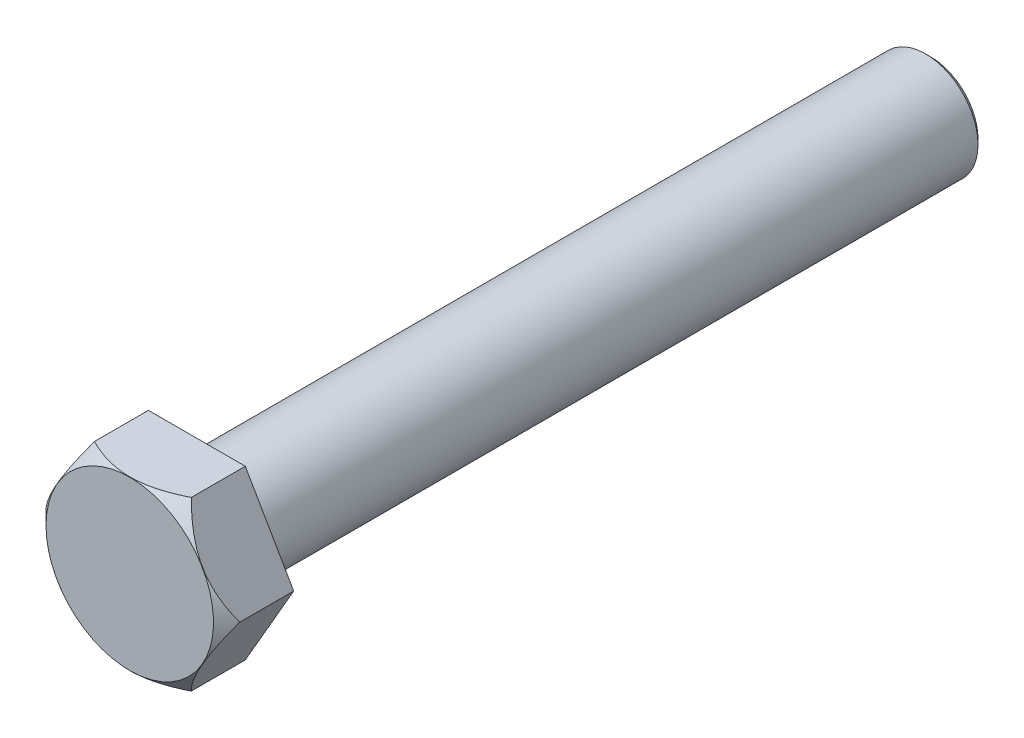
ISO-10303-21;
HEADER;
FILE_DESCRIPTION(('STEP AP214'),'2;1');
FILE_NAME('part.step','',(''),(''),'','','');
FILE_SCHEMA(('AUTOMOTIVE_DESIGN { 1 0 10303 214 1 1 1 1 }'));
ENDSEC;
DATA;
#1=APPLICATION_CONTEXT('core data for automotive mechanical design processes');
#2=APPLICATION_PROTOCOL_DEFINITION('international standard','automotive_design',2000,#1);
#3=PRODUCT_CONTEXT('',#1,'mechanical');
#4=PRODUCT('Part','Part','',(#3));
#5=PRODUCT_RELATED_PRODUCT_CATEGORY('part','',(#4));
#6=PRODUCT_DEFINITION_FORMATION('','',#4);
#7=PRODUCT_DEFINITION_CONTEXT('part definition',#1,'design');
#8=PRODUCT_DEFINITION('design','',#6,#7);
#9=PRODUCT_DEFINITION_SHAPE('','',#8);
#10=(LENGTH_UNIT() NAMED_UNIT(*) SI_UNIT(.MILLI.,.METRE.));
#11=(NAMED_UNIT(*) PLANE_ANGLE_UNIT() SI_UNIT($,.RADIAN.));
#12=(NAMED_UNIT(*) SI_UNIT($,.STERADIAN.) SOLID_ANGLE_UNIT());
#13=UNCERTAINTY_MEASURE_WITH_UNIT(LENGTH_MEASURE(1.E-05),#10,'distance_accuracy_value','');
#14=(GEOMETRIC_REPRESENTATION_CONTEXT(3) GLOBAL_UNCERTAINTY_ASSIGNED_CONTEXT((#13)) GLOBAL_UNIT_ASSIGNED_CONTEXT((#10,
#11,#12)) REPRESENTATION_CONTEXT('',''));
#15=CARTESIAN_POINT('',(0.,0.,0.));
#16=DIRECTION('',(0.,0.,1.));
#17=DIRECTION('',(1.,0.,0.));
#18=AXIS2_PLACEMENT_3D('',#15,#16,#17);
#19=CARTESIAN_POINT('',(0.,-5.,0.));
#20=DIRECTION('',(0.,0.,1.));
#21=DIRECTION('',(1.,0.,0.));
#22=AXIS2_PLACEMENT_3D('',#19,#20,#21);
#23=PLANE('',#22);
#24=CARTESIAN_POINT('',(0.,0.,0.));
#25=DIRECTION('',(0.,0.,1.));
#26=DIRECTION('',(1.,0.,0.));
#27=AXIS2_PLACEMENT_3D('',#24,#25,#26);
#28=CIRCLE('',#27,5.);
#29=CARTESIAN_POINT('',(5.,0.,0.));
#30=VERTEX_POINT('',#29);
#31=EDGE_CURVE('E11',#30,#30,#28,.T.);
#32=ORIENTED_EDGE('',*,*,#31,.T.);
#33=EDGE_LOOP('',(#32));
#34=FACE_BOUND('',#33,.T.);
#35=ADVANCED_FACE('F38',(#34),#23,.T.);
#36=CARTESIAN_POINT('',(0.,0.,0.));
#37=DIRECTION('',(0.,0.,1.));
#38=DIRECTION('',(1.,0.,0.));
#39=AXIS2_PLACEMENT_3D('',#36,#37,#38);
#40=CYLINDRICAL_SURFACE('',#39,5.);
#41=CARTESIAN_POINT('',(0.,0.,-69.5));
#42=DIRECTION('',(0.,0.,1.));
#43=DIRECTION('',(1.,0.,0.));
#44=AXIS2_PLACEMENT_3D('',#41,#42,#43);
#45=CIRCLE('',#44,5.);
#46=CARTESIAN_POINT('',(5.,0.,-69.5));
#47=VERTEX_POINT('',#46);
#48=EDGE_CURVE('E44',#47,#47,#45,.T.);
#49=ORIENTED_EDGE('',*,*,#48,.T.);
#50=EDGE_LOOP('',(#49));
#51=FACE_BOUND('',#50,.T.);
#52=ORIENTED_EDGE('',*,*,#31,.F.);
#53=EDGE_LOOP('',(#52));
#54=FACE_BOUND('',#53,.T.);
#55=ADVANCED_FACE('F64',(#51,#54),#40,.T.);
#56=CARTESIAN_POINT('',(0.,0.,-69.5));
#57=DIRECTION('',(0.,0.,1.));
#58=DIRECTION('',(1.,0.,0.));
#59=AXIS2_PLACEMENT_3D('',#56,#57,#58);
#60=CONICAL_SURFACE('',#59,5.,0.785398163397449);
#61=CARTESIAN_POINT('',(0.,0.,-70.));
#62=DIRECTION('',(0.,0.,1.));
#63=DIRECTION('',(1.,0.,0.));
#64=AXIS2_PLACEMENT_3D('',#61,#62,#63);
#65=CIRCLE('',#64,4.5);
#66=CARTESIAN_POINT('',(4.5,0.,-70.));
#67=VERTEX_POINT('',#66);
#68=EDGE_CURVE('E48',#67,#67,#65,.T.);
#69=ORIENTED_EDGE('',*,*,#68,.T.);
#70=EDGE_LOOP('',(#69));
#71=FACE_BOUND('',#70,.T.);
#72=ORIENTED_EDGE('',*,*,#48,.F.);
#73=EDGE_LOOP('',(#72));
#74=FACE_BOUND('',#73,.T.);
#75=ADVANCED_FACE('F55',(#71,#74),#60,.T.);
#76=CARTESIAN_POINT('',(0.,-4.5,-70.));
#77=DIRECTION('',(0.,0.,-1.));
#78=DIRECTION('',(-1.,0.,0.));
#79=AXIS2_PLACEMENT_3D('',#76,#77,#78);
#80=PLANE('',#79);
#81=ORIENTED_EDGE('',*,*,#68,.F.);
#82=EDGE_LOOP('',(#81));
#83=FACE_BOUND('',#82,.T.);
#84=ADVANCED_FACE('F58',(#83),#80,.T.);
#85=CLOSED_SHELL('',(#35,#55,#75,#84));
#86=MANIFOLD_SOLID_BREP('B2',#85);
#87=CARTESIAN_POINT('',(4.61880215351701,-8.,6.4));
#88=DIRECTION('',(-0.866025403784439,0.5,0.));
#89=DIRECTION('',(-0.5,-0.866025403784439,0.));
#90=AXIS2_PLACEMENT_3D('',#87,#88,#89);
#91=PLANE('',#90);
#92=DIRECTION('',(0.,0.,-1.));
#93=VECTOR('',#92,1.);
#94=CARTESIAN_POINT('',(9.23760430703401,0.,6.4));
#95=LINE('',#94,#93);
#96=CARTESIAN_POINT('',(9.23760430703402,0.,5.15));
#97=VERTEX_POINT('',#96);
#98=CARTESIAN_POINT('',(9.23760430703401,0.,0.));
#99=VERTEX_POINT('',#98);
#100=EDGE_CURVE('E36',#97,#99,#95,.T.);
#101=ORIENTED_EDGE('',*,*,#100,.F.);
#102=CARTESIAN_POINT('',(9.23771977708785,0.0002,5.14988452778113));
#103=CARTESIAN_POINT('',(9.15830362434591,-0.137352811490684,5.22929173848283));
#104=CARTESIAN_POINT('',(9.07827704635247,-0.275962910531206,5.30626202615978));
#105=CARTESIAN_POINT('',(8.91688328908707,-0.555505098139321,5.45458746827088));
#106=CARTESIAN_POINT('',(8.83551540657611,-0.696438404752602,5.52593955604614));
#107=CARTESIAN_POINT('',(8.58846429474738,-1.12434348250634,5.7310650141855));
#108=CARTESIAN_POINT('',(8.42068969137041,-1.41493761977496,5.85503254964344));
#109=CARTESIAN_POINT('',(8.08235881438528,-2.00094388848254,6.0673182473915));
#110=CARTESIAN_POINT('',(7.91188900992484,-2.29620625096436,6.15617121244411));
#111=CARTESIAN_POINT('',(7.65338180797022,-2.74395385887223,6.25895214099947));
#112=CARTESIAN_POINT('',(7.5668321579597,-2.89386225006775,6.2881156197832));
#113=CARTESIAN_POINT('',(7.39300005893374,-3.19494827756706,6.33561647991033));
#114=CARTESIAN_POINT('',(7.30571772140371,-3.34612572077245,6.35395547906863));
#115=CARTESIAN_POINT('',(7.09302093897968,-3.71452735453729,6.38470362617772));
#116=CARTESIAN_POINT('',(6.96737731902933,-3.93214848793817,6.3911549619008));
#117=CARTESIAN_POINT('',(6.71631655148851,-4.36699849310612,6.38032538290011));
#118=CARTESIAN_POINT('',(6.59089949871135,-4.58422720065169,6.36303614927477));
#119=CARTESIAN_POINT('',(6.3412478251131,-5.01663658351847,6.30574456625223));
#120=CARTESIAN_POINT('',(6.21701468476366,-5.23181469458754,6.26571681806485));
#121=CARTESIAN_POINT('',(5.97068367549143,-5.65847251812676,6.16512435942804));
#122=CARTESIAN_POINT('',(5.84858564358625,-5.86995251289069,6.1045612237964));
#123=CARTESIAN_POINT('',(5.63184322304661,-6.24536139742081,5.97996636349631));
#124=CARTESIAN_POINT('',(5.53671883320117,-6.41012167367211,5.91921187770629));
#125=CARTESIAN_POINT('',(5.34817758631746,-6.73668469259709,5.78791284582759));
#126=CARTESIAN_POINT('',(5.25476078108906,-6.89848734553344,5.7173680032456));
#127=CARTESIAN_POINT('',(5.06992894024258,-7.21862548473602,5.56806952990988));
#128=CARTESIAN_POINT('',(4.97850864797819,-7.37697007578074,5.48934171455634));
#129=CARTESIAN_POINT('',(4.79736084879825,-7.69072726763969,5.32471082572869));
#130=CARTESIAN_POINT('',(4.70763234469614,-7.84614159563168,5.23881215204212));
#131=CARTESIAN_POINT('',(4.61868668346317,-8.0002,5.14988452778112));
#132=B_SPLINE_CURVE_WITH_KNOTS('',3,(#102,#103,#104,#105,#106,#107,#108,#109,#110,#111,#112,
#113,#114,#115,#116,#117,#118,#119,#120,#121,#122,#123,#124,#125,#126,#127,#128,#129,#130,#131),
.UNSPECIFIED.,.F.,.F.,(4,2,2,2,2,2,2,2,2,2,2,2,2,2,4),(0.,0.532696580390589,1.06568194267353,
2.13740664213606,3.19211397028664,3.71843331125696,4.24467396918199,4.99761238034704,
5.75081469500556,6.50485999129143,7.25884747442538,7.85770857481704,8.45658781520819,
9.05363199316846,9.65031250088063),.UNSPECIFIED.);
#133=CARTESIAN_POINT('',(4.61880215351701,-8.,5.15));
#134=VERTEX_POINT('',#133);
#135=EDGE_CURVE('E199',#97,#134,#132,.T.);
#136=ORIENTED_EDGE('',*,*,#135,.T.);
#137=DIRECTION('',(0.,0.,-1.));
#138=VECTOR('',#137,1.);
#139=CARTESIAN_POINT('',(4.61880215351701,-8.,6.4));
#140=LINE('',#139,#138);
#141=CARTESIAN_POINT('',(4.61880215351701,-8.,0.));
#142=VERTEX_POINT('',#141);
#143=EDGE_CURVE('E116',#134,#142,#140,.T.);
#144=ORIENTED_EDGE('',*,*,#143,.T.);
#145=DIRECTION('',(0.5,0.866025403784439,0.));
#146=VECTOR('',#145,1.);
#147=CARTESIAN_POINT('',(4.61880215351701,-8.,0.));
#148=LINE('',#147,#146);
#149=EDGE_CURVE('E186',#142,#99,#148,.T.);
#150=ORIENTED_EDGE('',*,*,#149,.T.);
#151=EDGE_LOOP('',(#101,#136,#144,#150));
#152=FACE_BOUND('',#151,.T.);
#153=ADVANCED_FACE('F93',(#152),#91,.F.);
#154=CARTESIAN_POINT('',(9.23760430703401,0.,6.4));
#155=DIRECTION('',(-0.866025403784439,-0.5,0.));
#156=DIRECTION('',(0.5,-0.866025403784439,0.));
#157=AXIS2_PLACEMENT_3D('',#154,#155,#156);
#158=PLANE('',#157);
#159=DIRECTION('',(0.,0.,-1.));
#160=VECTOR('',#159,1.);
#161=CARTESIAN_POINT('',(4.61880215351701,8.,6.4));
#162=LINE('',#161,#160);
#163=CARTESIAN_POINT('',(4.61880215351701,8.,5.15));
#164=VERTEX_POINT('',#163);
#165=CARTESIAN_POINT('',(4.61880215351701,8.,0.));
#166=VERTEX_POINT('',#165);
#167=EDGE_CURVE('E101',#164,#166,#162,.T.);
#168=ORIENTED_EDGE('',*,*,#167,.F.);
#169=CARTESIAN_POINT('',(4.61868668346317,8.0002,5.14988452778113));
#170=CARTESIAN_POINT('',(4.69810283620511,7.86264718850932,5.22929173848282));
#171=CARTESIAN_POINT('',(4.77812941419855,7.7240370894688,5.30626202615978));
#172=CARTESIAN_POINT('',(4.93952317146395,7.44449490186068,5.45458746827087));
#173=CARTESIAN_POINT('',(5.02089105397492,7.3035615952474,5.52593955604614));
#174=CARTESIAN_POINT('',(5.26794216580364,6.87565651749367,5.7310650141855));
#175=CARTESIAN_POINT('',(5.43571676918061,6.58506238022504,5.85503254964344));
#176=CARTESIAN_POINT('',(5.77404764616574,5.99905611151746,6.0673182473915));
#177=CARTESIAN_POINT('',(5.94451745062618,5.70379374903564,6.15617121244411));
#178=CARTESIAN_POINT('',(6.2030246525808,5.25604614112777,6.25895214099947));
#179=CARTESIAN_POINT('',(6.28957430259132,5.10613774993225,6.2881156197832));
#180=CARTESIAN_POINT('',(6.46340640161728,4.80505172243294,6.33561647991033));
#181=CARTESIAN_POINT('',(6.55068873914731,4.65387427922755,6.35395547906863));
#182=CARTESIAN_POINT('',(6.76338552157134,4.28547264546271,6.38470362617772));
#183=CARTESIAN_POINT('',(6.88902914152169,4.06785151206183,6.3911549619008));
#184=CARTESIAN_POINT('',(7.14008990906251,3.63300150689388,6.38032538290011));
#185=CARTESIAN_POINT('',(7.26550696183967,3.41577279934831,6.36303614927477));
#186=CARTESIAN_POINT('',(7.51515863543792,2.98336341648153,6.30574456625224));
#187=CARTESIAN_POINT('',(7.63939177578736,2.76818530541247,6.26571681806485));
#188=CARTESIAN_POINT('',(7.88572278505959,2.34152748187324,6.16512435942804));
#189=CARTESIAN_POINT('',(8.00782081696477,2.13004748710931,6.1045612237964));
#190=CARTESIAN_POINT('',(8.22456323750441,1.75463860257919,5.97996636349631));
#191=CARTESIAN_POINT('',(8.31968762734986,1.58987832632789,5.91921187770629));
#192=CARTESIAN_POINT('',(8.50822887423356,1.26331530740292,5.78791284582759));
#193=CARTESIAN_POINT('',(8.60164567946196,1.10151265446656,5.7173680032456));
#194=CARTESIAN_POINT('',(8.78647752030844,0.78137451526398,5.56806952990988));
#195=CARTESIAN_POINT('',(8.87789781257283,0.623029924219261,5.48934171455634));
#196=CARTESIAN_POINT('',(9.05904561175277,0.309272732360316,5.3247108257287));
#197=CARTESIAN_POINT('',(9.14877411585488,0.153858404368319,5.23881215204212));
#198=CARTESIAN_POINT('',(9.23771977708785,-0.000200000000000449,5.14988452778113));
#199=B_SPLINE_CURVE_WITH_KNOTS('',3,(#169,#170,#171,#172,#173,#174,#175,#176,#177,#178,#179,
#180,#181,#182,#183,#184,#185,#186,#187,#188,#189,#190,#191,#192,#193,#194,#195,#196,#197,#198),
.UNSPECIFIED.,.F.,.F.,(4,2,2,2,2,2,2,2,2,2,2,2,2,2,4),(0.,0.53269658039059,1.06568194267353,
2.13740664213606,3.19211397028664,3.71843331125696,4.24467396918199,4.99761238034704,
5.75081469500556,6.50485999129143,7.25884747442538,7.85770857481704,8.45658781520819,
9.05363199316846,9.65031250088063),.UNSPECIFIED.);
#200=EDGE_CURVE('E200',#164,#97,#199,.T.);
#201=ORIENTED_EDGE('',*,*,#200,.T.);
#202=ORIENTED_EDGE('',*,*,#100,.T.);
#203=DIRECTION('',(-0.5,0.866025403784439,0.));
#204=VECTOR('',#203,1.);
#205=CARTESIAN_POINT('',(9.23760430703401,0.,0.));
#206=LINE('',#205,#204);
#207=EDGE_CURVE('E181',#99,#166,#206,.T.);
#208=ORIENTED_EDGE('',*,*,#207,.T.);
#209=EDGE_LOOP('',(#168,#201,#202,#208));
#210=FACE_BOUND('',#209,.T.);
#211=ADVANCED_FACE('F182',(#210),#158,.F.);
#212=CARTESIAN_POINT('',(4.61880215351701,8.,6.4));
#213=DIRECTION('',(0.,-1.,0.));
#214=DIRECTION('',(1.,0.,0.));
#215=AXIS2_PLACEMENT_3D('',#212,#213,#214);
#216=PLANE('',#215);
#217=DIRECTION('',(0.,0.,-1.));
#218=VECTOR('',#217,1.);
#219=CARTESIAN_POINT('',(-4.61880215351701,8.00000000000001,6.4));
#220=LINE('',#219,#218);
#221=CARTESIAN_POINT('',(-4.61880215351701,8.,5.15));
#222=VERTEX_POINT('',#221);
#223=CARTESIAN_POINT('',(-4.61880215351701,8.00000000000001,0.));
#224=VERTEX_POINT('',#223);
#225=EDGE_CURVE('E166',#222,#224,#220,.T.);
#226=ORIENTED_EDGE('',*,*,#225,.F.);
#227=CARTESIAN_POINT('',(-9.63405633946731,8.00000000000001,1.86502304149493));
#228=CARTESIAN_POINT('',(-9.40128275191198,8.00000000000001,2.0440636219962));
#229=CARTESIAN_POINT('',(-9.16725436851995,8.00000000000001,2.22149846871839));
#230=CARTESIAN_POINT('',(-8.69617533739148,8.00000000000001,2.57242325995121));
#231=CARTESIAN_POINT('',(-8.45912398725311,8.00000000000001,2.74591226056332));
#232=CARTESIAN_POINT('',(-7.97975398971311,8.00000000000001,3.08944656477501));
#233=CARTESIAN_POINT('',(-7.73740881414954,8.00000000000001,3.2594549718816));
#234=CARTESIAN_POINT('',(-7.24868415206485,8.00000000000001,3.59355068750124));
#235=CARTESIAN_POINT('',(-7.00230494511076,8.00000000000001,3.75763840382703));
#236=CARTESIAN_POINT('',(-6.48908013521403,8.00000000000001,4.08870680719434));
#237=CARTESIAN_POINT('',(-6.2219265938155,8.00000000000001,4.25521252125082));
#238=CARTESIAN_POINT('',(-5.68134615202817,8.00000000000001,4.57788231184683));
#239=CARTESIAN_POINT('',(-5.40791820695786,8.00000000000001,4.73404464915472));
#240=CARTESIAN_POINT('',(-4.85471531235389,8.00000000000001,5.0327014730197));
#241=CARTESIAN_POINT('',(-4.57496219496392,8.00000000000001,5.17523608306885));
#242=CARTESIAN_POINT('',(-4.00755071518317,8.00000000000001,5.44344401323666));
#243=CARTESIAN_POINT('',(-3.71989615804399,8.00000000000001,5.56912528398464));
#244=CARTESIAN_POINT('',(-3.16480511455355,8.00000000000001,5.78774810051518));
#245=CARTESIAN_POINT('',(-2.89816645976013,8.00000000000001,5.88269477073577));
#246=CARTESIAN_POINT('',(-2.35810027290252,8.00000000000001,6.05124489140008));
#247=CARTESIAN_POINT('',(-2.0846723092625,8.,6.12484698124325));
#248=CARTESIAN_POINT('',(-1.5374201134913,8.,6.24549882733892));
#249=CARTESIAN_POINT('',(-1.2637039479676,8.,6.29303051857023));
#250=CARTESIAN_POINT('',(-0.712876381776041,8.,6.36055070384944));
#251=CARTESIAN_POINT('',(-0.435765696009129,8.,6.38054490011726));
#252=CARTESIAN_POINT('',(0.106931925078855,8.,6.39128945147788));
#253=CARTESIAN_POINT('',(0.372494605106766,8.,6.38327664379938));
#254=CARTESIAN_POINT('',(0.901545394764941,8.,6.34128781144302));
#255=CARTESIAN_POINT('',(1.16503331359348,8.,6.30730942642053));
#256=CARTESIAN_POINT('',(1.69249295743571,8.,6.21473235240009));
#257=CARTESIAN_POINT('',(1.9563871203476,8.,6.15569917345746));
#258=CARTESIAN_POINT('',(2.47836483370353,8.,6.01628611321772));
#259=CARTESIAN_POINT('',(2.73644871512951,8.,5.93590745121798));
#260=CARTESIAN_POINT('',(3.26112199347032,8.,5.75215229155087));
#261=CARTESIAN_POINT('',(3.52733413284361,8.,5.64771079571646));
#262=CARTESIAN_POINT('',(4.0529103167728,8.,5.42269321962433));
#263=CARTESIAN_POINT('',(4.31227120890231,8.,5.30210986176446));
#264=CARTESIAN_POINT('',(4.82537016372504,8.,5.0476682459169));
#265=CARTESIAN_POINT('',(5.07908778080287,8.,4.91376909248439));
#266=CARTESIAN_POINT('',(5.5807089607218,8.,4.63564261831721));
#267=CARTESIAN_POINT('',(5.82861341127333,8.,4.49141688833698));
#268=CARTESIAN_POINT('',(6.30725136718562,8.,4.20198106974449));
#269=CARTESIAN_POINT('',(6.53822825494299,8.,4.05717133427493));
#270=CARTESIAN_POINT('',(6.99621369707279,8.,3.76138871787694));
#271=CARTESIAN_POINT('',(7.22322195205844,8.,3.61041537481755));
#272=CARTESIAN_POINT('',(7.67196405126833,8.,3.30463392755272));
#273=CARTESIAN_POINT('',(7.89372561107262,8.,3.14986635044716));
#274=CARTESIAN_POINT('',(8.33420656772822,8.,2.8361829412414));
#275=CARTESIAN_POINT('',(8.55292678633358,8.,2.67726826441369));
#276=CARTESIAN_POINT('',(8.77037123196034,8.,2.51665609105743));
#277=B_SPLINE_CURVE_WITH_KNOTS('',3,(#227,#228,#229,#230,#231,#232,#233,#234,#235,#236,#237,
#238,#239,#240,#241,#242,#243,#244,#245,#246,#247,#248,#249,#250,#251,#252,#253,#254,#255,#256,
#257,#258,#259,#260,#261,#262,#263,#264,#265,#266,#267,#268,#269,#270,#271,#272,#273,#274,#275,
#276),.UNSPECIFIED.,.F.,.F.,(4,2,2,2,2,2,2,2,2,2,2,2,2,2,2,2,2,2,2,2,2,2,2,2,4),(0.,
0.881010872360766,1.76223032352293,2.65024868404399,3.53820576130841,4.48240113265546,
5.42675486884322,6.36823655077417,7.30927251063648,8.15765736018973,9.00609627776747,
9.83827152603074,10.6702744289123,11.4660076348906,12.26181318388,13.0720226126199,
13.8821857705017,14.7394283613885,15.5970587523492,16.4574095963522,17.3176281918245,
18.1353653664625,18.9531639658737,19.7643957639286,20.5754039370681),.UNSPECIFIED.);
#278=EDGE_CURVE('E148',#222,#164,#277,.T.);
#279=ORIENTED_EDGE('',*,*,#278,.T.);
#280=ORIENTED_EDGE('',*,*,#167,.T.);
#281=DIRECTION('',(-1.,0.,0.));
#282=VECTOR('',#281,1.);
#283=CARTESIAN_POINT('',(4.61880215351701,8.,0.));
#284=LINE('',#283,#282);
#285=EDGE_CURVE('E177',#166,#224,#284,.T.);
#286=ORIENTED_EDGE('',*,*,#285,.T.);
#287=EDGE_LOOP('',(#226,#279,#280,#286));
#288=FACE_BOUND('',#287,.T.);
#289=ADVANCED_FACE('F175',(#288),#216,.F.);
#290=CARTESIAN_POINT('',(-4.61880215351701,8.00000000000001,6.4));
#291=DIRECTION('',(0.866025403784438,-0.5,0.));
#292=DIRECTION('',(0.5,0.866025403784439,0.));
#293=AXIS2_PLACEMENT_3D('',#290,#291,#292);
#294=PLANE('',#293);
#295=DIRECTION('',(0.,0.,-1.));
#296=VECTOR('',#295,1.);
#297=CARTESIAN_POINT('',(-9.23760430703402,0.,6.4));
#298=LINE('',#297,#296);
#299=CARTESIAN_POINT('',(-9.23760430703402,0.,5.15));
#300=VERTEX_POINT('',#299);
#301=CARTESIAN_POINT('',(-9.23760430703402,0.,0.));
#302=VERTEX_POINT('',#301);
#303=EDGE_CURVE('E157',#300,#302,#298,.T.);
#304=ORIENTED_EDGE('',*,*,#303,.F.);
#305=CARTESIAN_POINT('',(-9.23771977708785,-0.000199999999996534,5.14988452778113));
#306=CARTESIAN_POINT('',(-9.15830362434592,0.137352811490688,5.22929173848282));
#307=CARTESIAN_POINT('',(-9.07827704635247,0.27596291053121,5.30626202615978));
#308=CARTESIAN_POINT('',(-8.91688328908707,0.555505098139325,5.45458746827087));
#309=CARTESIAN_POINT('',(-8.83551540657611,0.696438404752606,5.52593955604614));
#310=CARTESIAN_POINT('',(-8.58846429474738,1.12434348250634,5.7310650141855));
#311=CARTESIAN_POINT('',(-8.42068969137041,1.41493761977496,5.85503254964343));
#312=CARTESIAN_POINT('',(-8.08235881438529,2.00094388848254,6.0673182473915));
#313=CARTESIAN_POINT('',(-7.91188900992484,2.29620625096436,6.15617121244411));
#314=CARTESIAN_POINT('',(-7.65338180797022,2.74395385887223,6.25895214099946));
#315=CARTESIAN_POINT('',(-7.56683215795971,2.89386225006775,6.28811561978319));
#316=CARTESIAN_POINT('',(-7.39300005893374,3.19494827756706,6.33561647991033));
#317=CARTESIAN_POINT('',(-7.30571772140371,3.34612572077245,6.35395547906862));
#318=CARTESIAN_POINT('',(-7.09302093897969,3.71452735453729,6.38470362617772));
#319=CARTESIAN_POINT('',(-6.96737731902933,3.93214848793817,6.3911549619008));
#320=CARTESIAN_POINT('',(-6.71631655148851,4.36699849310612,6.38032538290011));
#321=CARTESIAN_POINT('',(-6.59089949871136,4.58422720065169,6.36303614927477));
#322=CARTESIAN_POINT('',(-6.3412478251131,5.01663658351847,6.30574456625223));
#323=CARTESIAN_POINT('',(-6.21701468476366,5.23181469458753,6.26571681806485));
#324=CARTESIAN_POINT('',(-5.97068367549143,5.65847251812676,6.16512435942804));
#325=CARTESIAN_POINT('',(-5.84858564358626,5.86995251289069,6.1045612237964));
#326=CARTESIAN_POINT('',(-5.63184322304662,6.24536139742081,5.97996636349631));
#327=CARTESIAN_POINT('',(-5.53671883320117,6.41012167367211,5.91921187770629));
#328=CARTESIAN_POINT('',(-5.34817758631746,6.73668469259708,5.78791284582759));
#329=CARTESIAN_POINT('',(-5.25476078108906,6.89848734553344,5.7173680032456));
#330=CARTESIAN_POINT('',(-5.06992894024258,7.21862548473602,5.56806952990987));
#331=CARTESIAN_POINT('',(-4.97850864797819,7.37697007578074,5.48934171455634));
#332=CARTESIAN_POINT('',(-4.79736084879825,7.69072726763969,5.32471082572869));
#333=CARTESIAN_POINT('',(-4.70763234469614,7.84614159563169,5.23881215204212));
#334=CARTESIAN_POINT('',(-4.61868668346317,8.00020000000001,5.14988452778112));
#335=B_SPLINE_CURVE_WITH_KNOTS('',3,(#305,#306,#307,#308,#309,#310,#311,#312,#313,#314,#315,
#316,#317,#318,#319,#320,#321,#322,#323,#324,#325,#326,#327,#328,#329,#330,#331,#332,#333,#334),
.UNSPECIFIED.,.F.,.F.,(4,2,2,2,2,2,2,2,2,2,2,2,2,2,4),(0.,0.532696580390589,1.06568194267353,
2.13740664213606,3.19211397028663,3.71843331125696,4.24467396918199,4.99761238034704,
5.75081469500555,6.50485999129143,7.25884747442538,7.85770857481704,8.45658781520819,
9.05363199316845,9.65031250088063),.UNSPECIFIED.);
#336=EDGE_CURVE('E145',#300,#222,#335,.T.);
#337=ORIENTED_EDGE('',*,*,#336,.T.);
#338=ORIENTED_EDGE('',*,*,#225,.T.);
#339=DIRECTION('',(-0.5,-0.866025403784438,0.));
#340=VECTOR('',#339,1.);
#341=CARTESIAN_POINT('',(-4.61880215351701,8.00000000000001,0.));
#342=LINE('',#341,#340);
#343=EDGE_CURVE('E164',#224,#302,#342,.T.);
#344=ORIENTED_EDGE('',*,*,#343,.T.);
#345=EDGE_LOOP('',(#304,#337,#338,#344));
#346=FACE_BOUND('',#345,.T.);
#347=ADVANCED_FACE('F162',(#346),#294,.F.);
#348=CARTESIAN_POINT('',(-9.23760430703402,0.,6.4));
#349=DIRECTION('',(0.866025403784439,0.5,0.));
#350=DIRECTION('',(-0.5,0.866025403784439,0.));
#351=AXIS2_PLACEMENT_3D('',#348,#349,#350);
#352=PLANE('',#351);
#353=DIRECTION('',(0.,0.,-1.));
#354=VECTOR('',#353,1.);
#355=CARTESIAN_POINT('',(-4.61880215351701,-8.,6.4));
#356=LINE('',#355,#354);
#357=CARTESIAN_POINT('',(-4.61880215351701,-8.,5.15));
#358=VERTEX_POINT('',#357);
#359=CARTESIAN_POINT('',(-4.61880215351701,-8.,0.));
#360=VERTEX_POINT('',#359);
#361=EDGE_CURVE('E159',#358,#360,#356,.T.);
#362=ORIENTED_EDGE('',*,*,#361,.F.);
#363=CARTESIAN_POINT('',(-4.61868668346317,-8.0002,5.14988452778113));
#364=CARTESIAN_POINT('',(-4.69810283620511,-7.86264718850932,5.22929173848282));
#365=CARTESIAN_POINT('',(-4.77812941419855,-7.7240370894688,5.30626202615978));
#366=CARTESIAN_POINT('',(-4.93952317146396,-7.44449490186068,5.45458746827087));
#367=CARTESIAN_POINT('',(-5.02089105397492,-7.3035615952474,5.52593955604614));
#368=CARTESIAN_POINT('',(-5.26794216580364,-6.87565651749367,5.7310650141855));
#369=CARTESIAN_POINT('',(-5.43571676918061,-6.58506238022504,5.85503254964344));
#370=CARTESIAN_POINT('',(-5.77404764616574,-5.99905611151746,6.0673182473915));
#371=CARTESIAN_POINT('',(-5.94451745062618,-5.70379374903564,6.15617121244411));
#372=CARTESIAN_POINT('',(-6.2030246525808,-5.25604614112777,6.25895214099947));
#373=CARTESIAN_POINT('',(-6.28957430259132,-5.10613774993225,6.2881156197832));
#374=CARTESIAN_POINT('',(-6.46340640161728,-4.80505172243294,6.33561647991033));
#375=CARTESIAN_POINT('',(-6.55068873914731,-4.65387427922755,6.35395547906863));
#376=CARTESIAN_POINT('',(-6.76338552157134,-4.28547264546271,6.38470362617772));
#377=CARTESIAN_POINT('',(-6.88902914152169,-4.06785151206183,6.3911549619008));
#378=CARTESIAN_POINT('',(-7.14008990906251,-3.63300150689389,6.38032538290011));
#379=CARTESIAN_POINT('',(-7.26550696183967,-3.41577279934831,6.36303614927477));
#380=CARTESIAN_POINT('',(-7.51515863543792,-2.98336341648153,6.30574456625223));
#381=CARTESIAN_POINT('',(-7.63939177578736,-2.76818530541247,6.26571681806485));
#382=CARTESIAN_POINT('',(-7.88572278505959,-2.34152748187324,6.16512435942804));
#383=CARTESIAN_POINT('',(-8.00782081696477,-2.13004748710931,6.1045612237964));
#384=CARTESIAN_POINT('',(-8.22456323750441,-1.75463860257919,5.97996636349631));
#385=CARTESIAN_POINT('',(-8.31968762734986,-1.58987832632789,5.91921187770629));
#386=CARTESIAN_POINT('',(-8.50822887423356,-1.26331530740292,5.78791284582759));
#387=CARTESIAN_POINT('',(-8.60164567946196,-1.10151265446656,5.7173680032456));
#388=CARTESIAN_POINT('',(-8.78647752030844,-0.78137451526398,5.56806952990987));
#389=CARTESIAN_POINT('',(-8.87789781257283,-0.62302992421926,5.48934171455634));
#390=CARTESIAN_POINT('',(-9.05904561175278,-0.309272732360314,5.32471082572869));
#391=CARTESIAN_POINT('',(-9.14877411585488,-0.153858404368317,5.23881215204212));
#392=CARTESIAN_POINT('',(-9.23771977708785,0.000200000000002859,5.14988452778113));
#393=B_SPLINE_CURVE_WITH_KNOTS('',3,(#363,#364,#365,#366,#367,#368,#369,#370,#371,#372,#373,
#374,#375,#376,#377,#378,#379,#380,#381,#382,#383,#384,#385,#386,#387,#388,#389,#390,#391,#392),
.UNSPECIFIED.,.F.,.F.,(4,2,2,2,2,2,2,2,2,2,2,2,2,2,4),(0.,0.532696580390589,1.06568194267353,
2.13740664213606,3.19211397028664,3.71843331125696,4.24467396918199,4.99761238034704,
5.75081469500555,6.50485999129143,7.25884747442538,7.85770857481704,8.45658781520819,
9.05363199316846,9.65031250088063),.UNSPECIFIED.);
#394=EDGE_CURVE('E108',#358,#300,#393,.T.);
#395=ORIENTED_EDGE('',*,*,#394,.T.);
#396=ORIENTED_EDGE('',*,*,#303,.T.);
#397=DIRECTION('',(0.5,-0.866025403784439,0.));
#398=VECTOR('',#397,1.);
#399=CARTESIAN_POINT('',(-9.23760430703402,0.,0.));
#400=LINE('',#399,#398);
#401=EDGE_CURVE('E190',#302,#360,#400,.T.);
#402=ORIENTED_EDGE('',*,*,#401,.T.);
#403=EDGE_LOOP('',(#362,#395,#396,#402));
#404=FACE_BOUND('',#403,.T.);
#405=ADVANCED_FACE('F155',(#404),#352,.F.);
#406=CARTESIAN_POINT('',(-4.61880215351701,-8.,6.4));
#407=DIRECTION('',(0.,1.,0.));
#408=DIRECTION('',(-1.,0.,0.));
#409=AXIS2_PLACEMENT_3D('',#406,#407,#408);
#410=PLANE('',#409);
#411=ORIENTED_EDGE('',*,*,#143,.F.);
#412=CARTESIAN_POINT('',(-9.63405633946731,-8.,1.86502304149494));
#413=CARTESIAN_POINT('',(-9.40128275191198,-8.,2.0440636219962));
#414=CARTESIAN_POINT('',(-9.16725436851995,-8.,2.22149846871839));
#415=CARTESIAN_POINT('',(-8.69617533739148,-8.,2.57242325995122));
#416=CARTESIAN_POINT('',(-8.45912398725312,-8.,2.74591226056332));
#417=CARTESIAN_POINT('',(-7.97975398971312,-8.,3.08944656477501));
#418=CARTESIAN_POINT('',(-7.73740881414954,-8.,3.25945497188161));
#419=CARTESIAN_POINT('',(-7.24868415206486,-8.,3.59355068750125));
#420=CARTESIAN_POINT('',(-7.00230494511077,-8.,3.75763840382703));
#421=CARTESIAN_POINT('',(-6.48908013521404,-8.,4.08870680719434));
#422=CARTESIAN_POINT('',(-6.22192659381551,-8.,4.25521252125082));
#423=CARTESIAN_POINT('',(-5.68134615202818,-8.,4.57788231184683));
#424=CARTESIAN_POINT('',(-5.40791820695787,-8.,4.73404464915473));
#425=CARTESIAN_POINT('',(-4.85471531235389,-8.,5.0327014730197));
#426=CARTESIAN_POINT('',(-4.57496219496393,-8.,5.17523608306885));
#427=CARTESIAN_POINT('',(-4.00755071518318,-8.,5.44344401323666));
#428=CARTESIAN_POINT('',(-3.719896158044,-8.,5.56912528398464));
#429=CARTESIAN_POINT('',(-3.16480511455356,-8.,5.78774810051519));
#430=CARTESIAN_POINT('',(-2.89816645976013,-8.,5.88269477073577));
#431=CARTESIAN_POINT('',(-2.35810027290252,-8.,6.05124489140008));
#432=CARTESIAN_POINT('',(-2.0846723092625,-8.,6.12484698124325));
#433=CARTESIAN_POINT('',(-1.5374201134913,-8.,6.24549882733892));
#434=CARTESIAN_POINT('',(-1.26370394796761,-8.,6.29303051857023));
#435=CARTESIAN_POINT('',(-0.712876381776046,-8.,6.36055070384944));
#436=CARTESIAN_POINT('',(-0.435765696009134,-8.,6.38054490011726));
#437=CARTESIAN_POINT('',(0.10693192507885,-8.,6.39128945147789));
#438=CARTESIAN_POINT('',(0.37249460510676,-8.,6.38327664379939));
#439=CARTESIAN_POINT('',(0.901545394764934,-8.,6.34128781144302));
#440=CARTESIAN_POINT('',(1.16503331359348,-8.,6.30730942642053));
#441=CARTESIAN_POINT('',(1.6924929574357,-8.,6.21473235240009));
#442=CARTESIAN_POINT('',(1.95638712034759,-8.,6.15569917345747));
#443=CARTESIAN_POINT('',(2.47836483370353,-8.,6.01628611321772));
#444=CARTESIAN_POINT('',(2.73644871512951,-8.,5.93590745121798));
#445=CARTESIAN_POINT('',(3.26112199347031,-8.,5.75215229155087));
#446=CARTESIAN_POINT('',(3.52733413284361,-8.,5.64771079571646));
#447=CARTESIAN_POINT('',(4.05291031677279,-8.,5.42269321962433));
#448=CARTESIAN_POINT('',(4.31227120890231,-8.,5.30210986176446));
#449=CARTESIAN_POINT('',(4.82537016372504,-8.,5.0476682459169));
#450=CARTESIAN_POINT('',(5.07908778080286,-8.,4.91376909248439));
#451=CARTESIAN_POINT('',(5.58070896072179,-8.,4.63564261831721));
#452=CARTESIAN_POINT('',(5.82861341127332,-8.,4.49141688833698));
#453=CARTESIAN_POINT('',(6.30725136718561,-8.,4.20198106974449));
#454=CARTESIAN_POINT('',(6.53822825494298,-8.,4.05717133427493));
#455=CARTESIAN_POINT('',(6.99621369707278,-8.,3.76138871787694));
#456=CARTESIAN_POINT('',(7.22322195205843,-8.00000000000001,3.61041537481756));
#457=CARTESIAN_POINT('',(7.67196405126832,-8.00000000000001,3.30463392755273));
#458=CARTESIAN_POINT('',(7.89372561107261,-8.00000000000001,3.14986635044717));
#459=CARTESIAN_POINT('',(8.33420656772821,-8.00000000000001,2.83618294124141));
#460=CARTESIAN_POINT('',(8.55292678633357,-8.00000000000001,2.67726826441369));
#461=CARTESIAN_POINT('',(8.77037123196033,-8.00000000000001,2.51665609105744));
#462=B_SPLINE_CURVE_WITH_KNOTS('',3,(#412,#413,#414,#415,#416,#417,#418,#419,#420,#421,#422,
#423,#424,#425,#426,#427,#428,#429,#430,#431,#432,#433,#434,#435,#436,#437,#438,#439,#440,#441,
#442,#443,#444,#445,#446,#447,#448,#449,#450,#451,#452,#453,#454,#455,#456,#457,#458,#459,#460,
#461),.UNSPECIFIED.,.F.,.F.,(4,2,2,2,2,2,2,2,2,2,2,2,2,2,2,2,2,2,2,2,2,2,2,2,4),(0.,
0.881010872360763,1.76223032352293,2.65024868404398,3.5382057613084,4.48240113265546,
5.42675486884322,6.36823655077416,7.30927251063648,8.15765736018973,9.00609627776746,
9.83827152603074,10.6702744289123,11.4660076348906,12.26181318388,13.0720226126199,
13.8821857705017,14.7394283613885,15.5970587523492,16.4574095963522,17.3176281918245,
18.1353653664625,18.9531639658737,19.7643957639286,20.5754039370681),.UNSPECIFIED.);
#463=EDGE_CURVE('E160',#134,#358,#462,.F.);
#464=ORIENTED_EDGE('',*,*,#463,.T.);
#465=ORIENTED_EDGE('',*,*,#361,.T.);
#466=DIRECTION('',(1.,0.,0.));
#467=VECTOR('',#466,1.);
#468=CARTESIAN_POINT('',(-4.61880215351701,-8.,0.));
#469=LINE('',#468,#467);
#470=EDGE_CURVE('E195',#360,#142,#469,.T.);
#471=ORIENTED_EDGE('',*,*,#470,.T.);
#472=EDGE_LOOP('',(#411,#464,#465,#471));
#473=FACE_BOUND('',#472,.T.);
#474=ADVANCED_FACE('F198',(#473),#410,.F.);
#475=CARTESIAN_POINT('',(9.23760430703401,0.,0.));
#476=DIRECTION('',(0.,0.,1.));
#477=DIRECTION('',(1.,0.,0.));
#478=AXIS2_PLACEMENT_3D('',#475,#476,#477);
#479=PLANE('',#478);
#480=ORIENTED_EDGE('',*,*,#149,.F.);
#481=ORIENTED_EDGE('',*,*,#470,.F.);
#482=ORIENTED_EDGE('',*,*,#401,.F.);
#483=ORIENTED_EDGE('',*,*,#343,.F.);
#484=ORIENTED_EDGE('',*,*,#285,.F.);
#485=ORIENTED_EDGE('',*,*,#207,.F.);
#486=EDGE_LOOP('',(#480,#481,#482,#483,#484,#485));
#487=FACE_BOUND('',#486,.T.);
#488=ADVANCED_FACE('F188',(#487),#479,.F.);
#489=CARTESIAN_POINT('',(0.,0.,6.4));
#490=DIRECTION('',(0.,0.,-1.));
#491=DIRECTION('',(-1.,0.,0.));
#492=AXIS2_PLACEMENT_3D('',#489,#490,#491);
#493=CONICAL_SURFACE('',#492,7.98760430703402,0.785398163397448);
#494=CARTESIAN_POINT('',(0.,0.,6.4));
#495=DIRECTION('',(0.,0.,-1.));
#496=DIRECTION('',(-1.,0.,0.));
#497=AXIS2_PLACEMENT_3D('',#494,#495,#496);
#498=CIRCLE('',#497,7.98760430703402);
#499=CARTESIAN_POINT('',(-7.98760430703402,0.,6.4));
#500=VERTEX_POINT('',#499);
#501=EDGE_CURVE('E250',#500,#500,#498,.T.);
#502=ORIENTED_EDGE('',*,*,#501,.T.);
#503=EDGE_LOOP('',(#502));
#504=FACE_BOUND('',#503,.T.);
#505=ORIENTED_EDGE('',*,*,#200,.F.);
#506=ORIENTED_EDGE('',*,*,#278,.F.);
#507=ORIENTED_EDGE('',*,*,#336,.F.);
#508=ORIENTED_EDGE('',*,*,#394,.F.);
#509=ORIENTED_EDGE('',*,*,#463,.F.);
#510=ORIENTED_EDGE('',*,*,#135,.F.);
#511=EDGE_LOOP('',(#505,#506,#507,#508,#509,#510));
#512=FACE_BOUND('',#511,.T.);
#513=ADVANCED_FACE('F146',(#504,#512),#493,.T.);
#514=CARTESIAN_POINT('',(9.23760430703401,0.,6.4));
#515=DIRECTION('',(0.,0.,1.));
#516=DIRECTION('',(1.,0.,0.));
#517=AXIS2_PLACEMENT_3D('',#514,#515,#516);
#518=PLANE('',#517);
#519=ORIENTED_EDGE('',*,*,#501,.F.);
#520=EDGE_LOOP('',(#519));
#521=FACE_BOUND('',#520,.T.);
#522=ADVANCED_FACE('F214',(#521),#518,.T.);
#523=CLOSED_SHELL('',(#153,#211,#289,#347,#405,#474,#488,#513,#522));
#524=MANIFOLD_SOLID_BREP('B6',#523);
#525=ADVANCED_BREP_SHAPE_REPRESENTATION('',(#18,#86,#524),#14);
#526=SHAPE_DEFINITION_REPRESENTATION(#9,#525);
ENDSEC;
END-ISO-10303-21;
